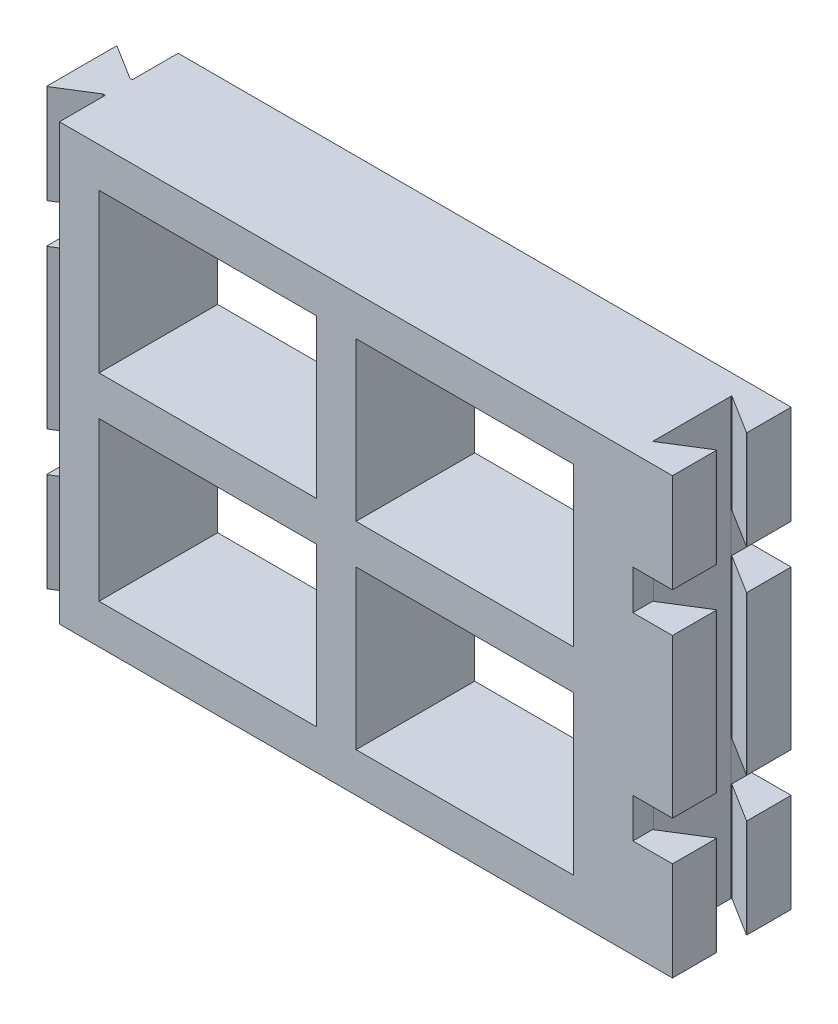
from build123d import *

# Parameters (mm, degrees)
SKETCH1_W           = 155
SKETCH1_H           = 110
BOSS_EXTRUDE4_DEPTH = 30
SKETCH6_W           = 55
SKETCH6_H           = 40
CUT_EXTRUDE6_DEPTH  = 30
SKETCH7_W           = 0.6
SKETCH7_H           = 6.834829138
BOSS_EXTRUDE5_DEPTH = 110
CUT_EXTRUDE7_DEPTH  = 110
FILLET4_R           = 0.1
FILLET5_R           = 0.1
SKETCH9_W           = 10
SKETCH9_H           = 10
CUT_EXTRUDE8_DEPTH  = 50


with BuildPart() as part:
    # Sketch1 → Boss-Extrude4 (new body)
    with BuildSketch(Plane.XY):
        with Locations((77.5, -55)):
            Rectangle(SKETCH1_W, SKETCH1_H)
    extrude(amount=BOSS_EXTRUDE4_DEPTH)

    # Sketch6 → Cut-Extrude6 (cut)
    with BuildSketch(Plane.XY.offset(30)):
        with Locations((37.5, -30)):
            Rectangle(SKETCH6_W, SKETCH6_H)
        with Locations((102.5, -30)):
            Rectangle(SKETCH6_W, SKETCH6_H)
        with Locations((102.5, -80)):
            Rectangle(SKETCH6_W, SKETCH6_H)
        with Locations((37.5, -80)):
            Rectangle(SKETCH6_W, SKETCH6_H)
    extrude(amount=-CUT_EXTRUDE6_DEPTH, mode=Mode.SUBTRACT)

    # Sketch7 → Boss-Extrude5 (add)
    with BuildSketch(Plane.XZ.offset(110)):
        Polygon((-9.402090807, 6.082428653), (-9.402090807, 23.917571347), (-0.6, 18.417414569), (-0.6, 11.582585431), align=None)
        with Locations((-0.3, 15)):
            Rectangle(SKETCH7_W, SKETCH7_H)
    extrude(amount=-BOSS_EXTRUDE5_DEPTH)

    # Sketch7_3 → Cut-Extrude7 (cut)
    with BuildSketch(Plane.XZ.offset(110)):
        Polygon((155, 11.25), (155, 18.75), (144.997909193, 25), (144.997909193, 5), align=None)
    extrude(amount=-CUT_EXTRUDE7_DEPTH, mode=Mode.SUBTRACT)

    # Fillet4
    fillet4_edges = [part.edges().sort_by_distance(p)[0] for p in [
        (144.997909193, -55, 25),
        (155, -55, 18.75),
        (155, -55, 11.25),
        (144.997909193, -55, 5),
    ]]
    fillet(fillet4_edges, radius=FILLET4_R)

    # Fillet5
    fillet5_edges = [part.edges().sort_by_distance(p)[0] for p in [
        (-9.402090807, -55, 6.082428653),
        (-9.402090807, -55, 23.917571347),
    ]]
    fillet(fillet5_edges, radius=FILLET5_R)

    # Sketch9 → Cut-Extrude8 (cut)
    with BuildSketch(Plane.XY.offset(30)):
        with Locations((150, -80)):
            Rectangle(SKETCH9_W, SKETCH9_H)
        with Locations((150, -30)):
            Rectangle(SKETCH9_W, SKETCH9_H)
        with Locations((-5, -80)):
            Rectangle(SKETCH9_W, SKETCH9_H)
        with Locations((-5, -30)):
            Rectangle(SKETCH9_W, SKETCH9_H)
    extrude(amount=-CUT_EXTRUDE8_DEPTH, mode=Mode.SUBTRACT)


solid = part.part
